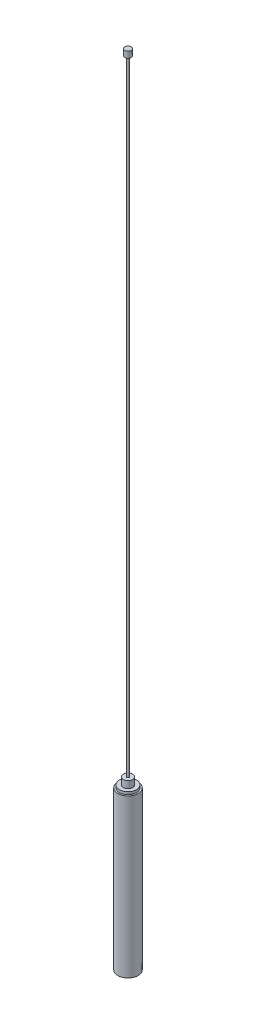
ISO-10303-21;
HEADER;
FILE_DESCRIPTION(('STEP AP214'),'2;1');
FILE_NAME('part.step','',(''),(''),'','','');
FILE_SCHEMA(('AUTOMOTIVE_DESIGN { 1 0 10303 214 1 1 1 1 }'));
ENDSEC;
DATA;
#1=APPLICATION_CONTEXT('core data for automotive mechanical design processes');
#2=APPLICATION_PROTOCOL_DEFINITION('international standard','automotive_design',2000,#1);
#3=PRODUCT_CONTEXT('',#1,'mechanical');
#4=PRODUCT('Part','Part','',(#3));
#5=PRODUCT_RELATED_PRODUCT_CATEGORY('part','',(#4));
#6=PRODUCT_DEFINITION_FORMATION('','',#4);
#7=PRODUCT_DEFINITION_CONTEXT('part definition',#1,'design');
#8=PRODUCT_DEFINITION('design','',#6,#7);
#9=PRODUCT_DEFINITION_SHAPE('','',#8);
#10=(LENGTH_UNIT() NAMED_UNIT(*) SI_UNIT(.MILLI.,.METRE.));
#11=(NAMED_UNIT(*) PLANE_ANGLE_UNIT() SI_UNIT($,.RADIAN.));
#12=(NAMED_UNIT(*) SI_UNIT($,.STERADIAN.) SOLID_ANGLE_UNIT());
#13=UNCERTAINTY_MEASURE_WITH_UNIT(LENGTH_MEASURE(1.E-05),#10,'distance_accuracy_value','');
#14=(GEOMETRIC_REPRESENTATION_CONTEXT(3) GLOBAL_UNCERTAINTY_ASSIGNED_CONTEXT((#13)) GLOBAL_UNIT_ASSIGNED_CONTEXT((#10,
#11,#12)) REPRESENTATION_CONTEXT('',''));
#15=CARTESIAN_POINT('',(0.,0.,0.));
#16=DIRECTION('',(0.,0.,1.));
#17=DIRECTION('',(1.,0.,0.));
#18=AXIS2_PLACEMENT_3D('',#15,#16,#17);
#19=CARTESIAN_POINT('',(0.,1265.,0.));
#20=DIRECTION('',(0.,-1.,0.));
#21=DIRECTION('',(0.,0.,-1.));
#22=AXIS2_PLACEMENT_3D('',#19,#20,#21);
#23=CYLINDRICAL_SURFACE('',#22,1.5);
#24=CARTESIAN_POINT('',(0.,265.,0.));
#25=DIRECTION('',(0.,1.,0.));
#26=DIRECTION('',(0.,0.,1.));
#27=AXIS2_PLACEMENT_3D('',#24,#25,#26);
#28=CIRCLE('',#27,1.5);
#29=CARTESIAN_POINT('',(0.,265.,1.5));
#30=VERTEX_POINT('',#29);
#31=EDGE_CURVE('E56',#30,#30,#28,.T.);
#32=ORIENTED_EDGE('',*,*,#31,.T.);
#33=EDGE_LOOP('',(#32));
#34=FACE_BOUND('',#33,.T.);
#35=CARTESIAN_POINT('',(0.,1255.,0.));
#36=DIRECTION('',(0.,1.,0.));
#37=DIRECTION('',(0.,0.,1.));
#38=AXIS2_PLACEMENT_3D('',#35,#36,#37);
#39=CIRCLE('',#38,1.5);
#40=CARTESIAN_POINT('',(0.,1255.,1.5));
#41=VERTEX_POINT('',#40);
#42=EDGE_CURVE('E11',#41,#41,#39,.T.);
#43=ORIENTED_EDGE('',*,*,#42,.F.);
#44=EDGE_LOOP('',(#43));
#45=FACE_BOUND('',#44,.T.);
#46=ADVANCED_FACE('F50',(#34,#45),#23,.T.);
#47=CARTESIAN_POINT('',(0.,265.,0.));
#48=DIRECTION('',(0.,1.,0.));
#49=DIRECTION('',(0.,0.,1.));
#50=AXIS2_PLACEMENT_3D('',#47,#48,#49);
#51=PLANE('',#50);
#52=ORIENTED_EDGE('',*,*,#31,.F.);
#53=EDGE_LOOP('',(#52));
#54=FACE_BOUND('',#53,.T.);
#55=ADVANCED_FACE('F75',(#54),#51,.F.);
#56=CARTESIAN_POINT('',(0.,1255.,0.));
#57=DIRECTION('',(0.,1.,0.));
#58=DIRECTION('',(0.,0.,1.));
#59=AXIS2_PLACEMENT_3D('',#56,#57,#58);
#60=CYLINDRICAL_SURFACE('',#59,5.);
#61=CARTESIAN_POINT('',(0.,1255.,0.));
#62=DIRECTION('',(0.,1.,0.));
#63=DIRECTION('',(0.,0.,1.));
#64=AXIS2_PLACEMENT_3D('',#61,#62,#63);
#65=CIRCLE('',#64,5.);
#66=CARTESIAN_POINT('',(0.,1255.,5.));
#67=VERTEX_POINT('',#66);
#68=EDGE_CURVE('E60',#67,#67,#65,.T.);
#69=ORIENTED_EDGE('',*,*,#68,.T.);
#70=EDGE_LOOP('',(#69));
#71=FACE_BOUND('',#70,.T.);
#72=CARTESIAN_POINT('',(0.,1265.,0.));
#73=DIRECTION('',(0.,1.,0.));
#74=DIRECTION('',(0.,0.,1.));
#75=AXIS2_PLACEMENT_3D('',#72,#73,#74);
#76=CIRCLE('',#75,5.);
#77=CARTESIAN_POINT('',(0.,1265.,5.));
#78=VERTEX_POINT('',#77);
#79=EDGE_CURVE('E64',#78,#78,#76,.T.);
#80=ORIENTED_EDGE('',*,*,#79,.F.);
#81=EDGE_LOOP('',(#80));
#82=FACE_BOUND('',#81,.T.);
#83=ADVANCED_FACE('F72',(#71,#82),#60,.T.);
#84=CARTESIAN_POINT('',(0.,1255.,0.));
#85=DIRECTION('',(0.,1.,0.));
#86=DIRECTION('',(0.,0.,1.));
#87=AXIS2_PLACEMENT_3D('',#84,#85,#86);
#88=PLANE('',#87);
#89=ORIENTED_EDGE('',*,*,#42,.T.);
#90=EDGE_LOOP('',(#89));
#91=FACE_BOUND('',#90,.T.);
#92=ORIENTED_EDGE('',*,*,#68,.F.);
#93=EDGE_LOOP('',(#92));
#94=FACE_BOUND('',#93,.T.);
#95=ADVANCED_FACE('F74',(#91,#94),#88,.F.);
#96=CARTESIAN_POINT('',(0.,1265.,0.));
#97=DIRECTION('',(0.,1.,0.));
#98=DIRECTION('',(0.,0.,1.));
#99=AXIS2_PLACEMENT_3D('',#96,#97,#98);
#100=PLANE('',#99);
#101=ORIENTED_EDGE('',*,*,#79,.T.);
#102=EDGE_LOOP('',(#101));
#103=FACE_BOUND('',#102,.T.);
#104=ADVANCED_FACE('F70',(#103),#100,.T.);
#105=CLOSED_SHELL('',(#46,#55,#83,#95,#104));
#106=MANIFOLD_SOLID_BREP('B2',#105);
#107=CARTESIAN_POINT('',(0.,5.,0.));
#108=DIRECTION('',(0.,-1.,0.));
#109=DIRECTION('',(0.,0.,-1.));
#110=AXIS2_PLACEMENT_3D('',#107,#108,#109);
#111=CYLINDRICAL_SURFACE('',#110,14.179869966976);
#112=CARTESIAN_POINT('',(0.,5.,0.));
#113=DIRECTION('',(0.,1.,0.));
#114=DIRECTION('',(0.,0.,1.));
#115=AXIS2_PLACEMENT_3D('',#112,#113,#114);
#116=CIRCLE('',#115,14.179869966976);
#117=CARTESIAN_POINT('',(0.,5.,14.179869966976));
#118=VERTEX_POINT('',#117);
#119=EDGE_CURVE('E49',#118,#118,#116,.T.);
#120=ORIENTED_EDGE('',*,*,#119,.F.);
#121=EDGE_LOOP('',(#120));
#122=FACE_BOUND('',#121,.T.);
#123=CARTESIAN_POINT('',(0.,1.,0.));
#124=DIRECTION('',(0.,1.,0.));
#125=DIRECTION('',(0.,0.,1.));
#126=AXIS2_PLACEMENT_3D('',#123,#124,#125);
#127=CIRCLE('',#126,14.179869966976);
#128=CARTESIAN_POINT('',(0.,1.,14.179869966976));
#129=VERTEX_POINT('',#128);
#130=EDGE_CURVE('E143',#129,#129,#127,.T.);
#131=ORIENTED_EDGE('',*,*,#130,.T.);
#132=EDGE_LOOP('',(#131));
#133=FACE_BOUND('',#132,.T.);
#134=ADVANCED_FACE('F140',(#122,#133),#111,.T.);
#135=CARTESIAN_POINT('',(0.,5.,0.));
#136=DIRECTION('',(0.,1.,0.));
#137=DIRECTION('',(0.,0.,1.));
#138=AXIS2_PLACEMENT_3D('',#135,#136,#137);
#139=PLANE('',#138);
#140=ORIENTED_EDGE('',*,*,#119,.T.);
#141=EDGE_LOOP('',(#140));
#142=FACE_BOUND('',#141,.T.);
#143=ADVANCED_FACE('F155',(#142),#139,.T.);
#144=CARTESIAN_POINT('',(0.,1.,0.));
#145=DIRECTION('',(0.,1.,0.));
#146=DIRECTION('',(0.,0.,1.));
#147=AXIS2_PLACEMENT_3D('',#144,#145,#146);
#148=PLANE('',#147);
#149=ORIENTED_EDGE('',*,*,#130,.F.);
#150=EDGE_LOOP('',(#149));
#151=FACE_BOUND('',#150,.T.);
#152=ADVANCED_FACE('F153',(#151),#148,.F.);
#153=CLOSED_SHELL('',(#134,#143,#152));
#154=MANIFOLD_SOLID_BREP('B6',#153);
#155=CARTESIAN_POINT('',(0.,250.,0.));
#156=DIRECTION('',(0.,-1.,0.));
#157=DIRECTION('',(0.,0.,-1.));
#158=AXIS2_PLACEMENT_3D('',#155,#156,#157);
#159=CYLINDRICAL_SURFACE('',#158,16.);
#160=CARTESIAN_POINT('',(0.,250.,0.));
#161=DIRECTION('',(0.,1.,0.));
#162=DIRECTION('',(0.,0.,1.));
#163=AXIS2_PLACEMENT_3D('',#160,#161,#162);
#164=CIRCLE('',#163,16.);
#165=CARTESIAN_POINT('',(0.,250.,16.));
#166=VERTEX_POINT('',#165);
#167=EDGE_CURVE('E200',#166,#166,#164,.T.);
#168=ORIENTED_EDGE('',*,*,#167,.F.);
#169=EDGE_LOOP('',(#168));
#170=FACE_BOUND('',#169,.T.);
#171=CARTESIAN_POINT('',(0.,0.,0.));
#172=DIRECTION('',(0.,1.,0.));
#173=DIRECTION('',(0.,0.,1.));
#174=AXIS2_PLACEMENT_3D('',#171,#172,#173);
#175=CIRCLE('',#174,16.);
#176=CARTESIAN_POINT('',(0.,0.,16.));
#177=VERTEX_POINT('',#176);
#178=EDGE_CURVE('E209',#177,#177,#175,.T.);
#179=ORIENTED_EDGE('',*,*,#178,.T.);
#180=EDGE_LOOP('',(#179));
#181=FACE_BOUND('',#180,.T.);
#182=ADVANCED_FACE('F186',(#170,#181),#159,.T.);
#183=CARTESIAN_POINT('',(0.,250.,0.));
#184=DIRECTION('',(0.,1.,0.));
#185=DIRECTION('',(0.,0.,1.));
#186=AXIS2_PLACEMENT_3D('',#183,#184,#185);
#187=PLANE('',#186);
#188=CARTESIAN_POINT('',(0.,250.,0.));
#189=DIRECTION('',(0.,1.,0.));
#190=DIRECTION('',(0.,0.,1.));
#191=AXIS2_PLACEMENT_3D('',#188,#189,#190);
#192=CIRCLE('',#191,13.5);
#193=CARTESIAN_POINT('',(0.,250.,13.5));
#194=VERTEX_POINT('',#193);
#195=EDGE_CURVE('E194',#194,#194,#192,.T.);
#196=ORIENTED_EDGE('',*,*,#195,.F.);
#197=EDGE_LOOP('',(#196));
#198=FACE_BOUND('',#197,.T.);
#199=ORIENTED_EDGE('',*,*,#167,.T.);
#200=EDGE_LOOP('',(#199));
#201=FACE_BOUND('',#200,.T.);
#202=ADVANCED_FACE('F221',(#198,#201),#187,.T.);
#203=CARTESIAN_POINT('',(0.,0.,0.));
#204=DIRECTION('',(0.,1.,0.));
#205=DIRECTION('',(0.,0.,1.));
#206=AXIS2_PLACEMENT_3D('',#203,#204,#205);
#207=PLANE('',#206);
#208=CARTESIAN_POINT('',(0.,0.,0.));
#209=DIRECTION('',(0.,-1.,0.));
#210=DIRECTION('',(0.,0.,-1.));
#211=AXIS2_PLACEMENT_3D('',#208,#209,#210);
#212=CIRCLE('',#211,14.2258593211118);
#213=CARTESIAN_POINT('',(0.,0.,-14.2258593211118));
#214=VERTEX_POINT('',#213);
#215=EDGE_CURVE('E347',#214,#214,#212,.T.);
#216=ORIENTED_EDGE('',*,*,#215,.F.);
#217=EDGE_LOOP('',(#216));
#218=FACE_BOUND('',#217,.T.);
#219=ORIENTED_EDGE('',*,*,#178,.F.);
#220=EDGE_LOOP('',(#219));
#221=FACE_BOUND('',#220,.T.);
#222=ADVANCED_FACE('F218',(#218,#221),#207,.F.);
#223=CARTESIAN_POINT('',(0.,254.,0.));
#224=DIRECTION('',(0.,-1.,0.));
#225=DIRECTION('',(0.,0.,-1.));
#226=AXIS2_PLACEMENT_3D('',#223,#224,#225);
#227=CYLINDRICAL_SURFACE('',#226,13.5);
#228=CARTESIAN_POINT('',(0.,254.,0.));
#229=DIRECTION('',(0.,1.,0.));
#230=DIRECTION('',(0.,0.,1.));
#231=AXIS2_PLACEMENT_3D('',#228,#229,#230);
#232=CIRCLE('',#231,13.5);
#233=CARTESIAN_POINT('',(0.,254.,13.5));
#234=VERTEX_POINT('',#233);
#235=EDGE_CURVE('E206',#234,#234,#232,.T.);
#236=ORIENTED_EDGE('',*,*,#235,.F.);
#237=EDGE_LOOP('',(#236));
#238=FACE_BOUND('',#237,.T.);
#239=ORIENTED_EDGE('',*,*,#195,.T.);
#240=EDGE_LOOP('',(#239));
#241=FACE_BOUND('',#240,.T.);
#242=ADVANCED_FACE('F220',(#238,#241),#227,.T.);
#243=CARTESIAN_POINT('',(0.,254.,0.));
#244=DIRECTION('',(0.,1.,0.));
#245=DIRECTION('',(0.,0.,1.));
#246=AXIS2_PLACEMENT_3D('',#243,#244,#245);
#247=PLANE('',#246);
#248=CARTESIAN_POINT('',(0.,254.,0.));
#249=DIRECTION('',(0.,1.,0.));
#250=DIRECTION('',(0.,0.,1.));
#251=AXIS2_PLACEMENT_3D('',#248,#249,#250);
#252=CIRCLE('',#251,7.53473540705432);
#253=CARTESIAN_POINT('',(0.,254.,7.53473540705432));
#254=VERTEX_POINT('',#253);
#255=EDGE_CURVE('E139',#254,#254,#252,.T.);
#256=ORIENTED_EDGE('',*,*,#255,.F.);
#257=EDGE_LOOP('',(#256));
#258=FACE_BOUND('',#257,.T.);
#259=ORIENTED_EDGE('',*,*,#235,.T.);
#260=EDGE_LOOP('',(#259));
#261=FACE_BOUND('',#260,.T.);
#262=ADVANCED_FACE('F227',(#258,#261),#247,.T.);
#263=CARTESIAN_POINT('',(0.,265.,0.));
#264=DIRECTION('',(0.,-1.,0.));
#265=DIRECTION('',(0.,0.,-1.));
#266=AXIS2_PLACEMENT_3D('',#263,#264,#265);
#267=CYLINDRICAL_SURFACE('',#266,7.53473540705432);
#268=CARTESIAN_POINT('',(0.,265.,0.));
#269=DIRECTION('',(0.,1.,0.));
#270=DIRECTION('',(0.,0.,1.));
#271=AXIS2_PLACEMENT_3D('',#268,#269,#270);
#272=CIRCLE('',#271,7.53473540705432);
#273=CARTESIAN_POINT('',(0.,265.,7.53473540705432));
#274=VERTEX_POINT('',#273);
#275=EDGE_CURVE('E204',#274,#274,#272,.T.);
#276=ORIENTED_EDGE('',*,*,#275,.F.);
#277=EDGE_LOOP('',(#276));
#278=FACE_BOUND('',#277,.T.);
#279=ORIENTED_EDGE('',*,*,#255,.T.);
#280=EDGE_LOOP('',(#279));
#281=FACE_BOUND('',#280,.T.);
#282=ADVANCED_FACE('F261',(#278,#281),#267,.T.);
#283=CARTESIAN_POINT('',(0.,265.,0.));
#284=DIRECTION('',(0.,1.,0.));
#285=DIRECTION('',(0.,0.,1.));
#286=AXIS2_PLACEMENT_3D('',#283,#284,#285);
#287=PLANE('',#286);
#288=CARTESIAN_POINT('',(0.,265.,0.));
#289=DIRECTION('',(0.,1.,0.));
#290=DIRECTION('',(0.,0.,1.));
#291=AXIS2_PLACEMENT_3D('',#288,#289,#290);
#292=CIRCLE('',#291,1.75196343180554);
#293=CARTESIAN_POINT('',(0.,265.,1.75196343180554));
#294=VERTEX_POINT('',#293);
#295=EDGE_CURVE('E343',#294,#294,#292,.T.);
#296=ORIENTED_EDGE('',*,*,#295,.F.);
#297=EDGE_LOOP('',(#296));
#298=FACE_BOUND('',#297,.T.);
#299=ORIENTED_EDGE('',*,*,#275,.T.);
#300=EDGE_LOOP('',(#299));
#301=FACE_BOUND('',#300,.T.);
#302=ADVANCED_FACE('F271',(#298,#301),#287,.T.);
#303=CARTESIAN_POINT('',(0.,248.,0.));
#304=DIRECTION('',(0.,-1.,0.));
#305=DIRECTION('',(0.,0.,-1.));
#306=AXIS2_PLACEMENT_3D('',#303,#304,#305);
#307=CYLINDRICAL_SURFACE('',#306,14.2258593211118);
#308=CARTESIAN_POINT('',(0.,248.,0.));
#309=DIRECTION('',(0.,-1.,0.));
#310=DIRECTION('',(0.,0.,-1.));
#311=AXIS2_PLACEMENT_3D('',#308,#309,#310);
#312=CIRCLE('',#311,14.2258593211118);
#313=CARTESIAN_POINT('',(0.,248.,-14.2258593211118));
#314=VERTEX_POINT('',#313);
#315=EDGE_CURVE('E349',#314,#314,#312,.T.);
#316=ORIENTED_EDGE('',*,*,#315,.F.);
#317=EDGE_LOOP('',(#316));
#318=FACE_BOUND('',#317,.T.);
#319=ORIENTED_EDGE('',*,*,#215,.T.);
#320=EDGE_LOOP('',(#319));
#321=FACE_BOUND('',#320,.T.);
#322=ADVANCED_FACE('F285',(#318,#321),#307,.F.);
#323=CARTESIAN_POINT('',(0.,248.,0.));
#324=DIRECTION('',(0.,-1.,0.));
#325=DIRECTION('',(0.,0.,-1.));
#326=AXIS2_PLACEMENT_3D('',#323,#324,#325);
#327=PLANE('',#326);
#328=CARTESIAN_POINT('',(0.,248.,0.));
#329=DIRECTION('',(0.,-1.,0.));
#330=DIRECTION('',(0.,0.,-1.));
#331=AXIS2_PLACEMENT_3D('',#328,#329,#330);
#332=CIRCLE('',#331,1.75196343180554);
#333=CARTESIAN_POINT('',(0.,248.,-1.75196343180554));
#334=VERTEX_POINT('',#333);
#335=EDGE_CURVE('E189',#334,#334,#332,.T.);
#336=ORIENTED_EDGE('',*,*,#335,.F.);
#337=EDGE_LOOP('',(#336));
#338=FACE_BOUND('',#337,.T.);
#339=ORIENTED_EDGE('',*,*,#315,.T.);
#340=EDGE_LOOP('',(#339));
#341=FACE_BOUND('',#340,.T.);
#342=ADVANCED_FACE('F290',(#338,#341),#327,.T.);
#343=CARTESIAN_POINT('',(0.,17.,0.));
#344=DIRECTION('',(0.,1.,0.));
#345=DIRECTION('',(0.,0.,1.));
#346=AXIS2_PLACEMENT_3D('',#343,#344,#345);
#347=CYLINDRICAL_SURFACE('',#346,1.75196343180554);
#348=ORIENTED_EDGE('',*,*,#335,.T.);
#349=EDGE_LOOP('',(#348));
#350=FACE_BOUND('',#349,.T.);
#351=ORIENTED_EDGE('',*,*,#295,.T.);
#352=EDGE_LOOP('',(#351));
#353=FACE_BOUND('',#352,.T.);
#354=ADVANCED_FACE('F309',(#350,#353),#347,.F.);
#355=CLOSED_SHELL('',(#182,#202,#222,#242,#262,#282,#302,#322,#342,#354));
#356=MANIFOLD_SOLID_BREP('B44',#355);
#357=ADVANCED_BREP_SHAPE_REPRESENTATION('',(#18,#106,#154,#356),#14);
#358=SHAPE_DEFINITION_REPRESENTATION(#9,#357);
ENDSEC;
END-ISO-10303-21;
